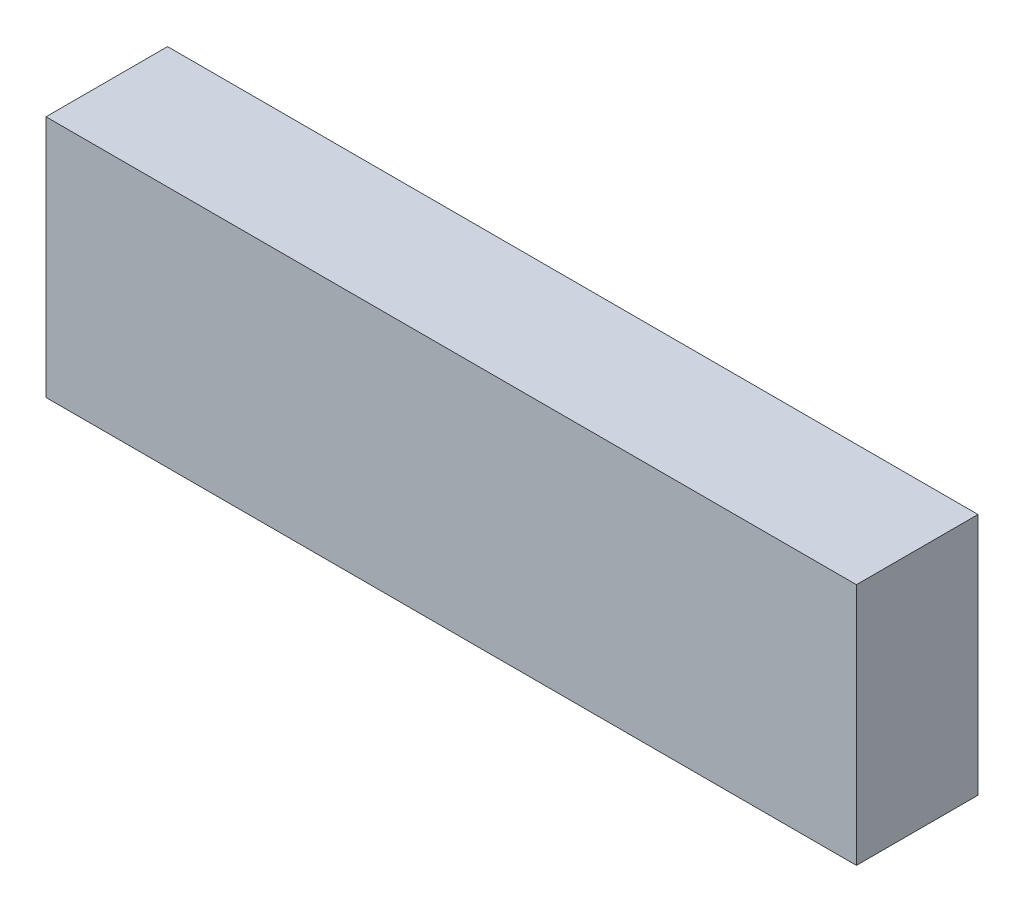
from build123d import *

# Parameters (mm, degrees)
SKETCH1_W           = 254
SKETCH1_H           = 38.1
BOSS_EXTRUDE1_DEPTH = 76.2


with BuildPart() as part:
    # Sketch1 → Boss-Extrude1 (new body)
    with BuildSketch(Plane(origin=(0, 0, 0), x_dir=(1, 0, 0), z_dir=(0, 1, 0))):
        Rectangle(SKETCH1_W, SKETCH1_H)
    extrude(amount=BOSS_EXTRUDE1_DEPTH)


solid = part.part
